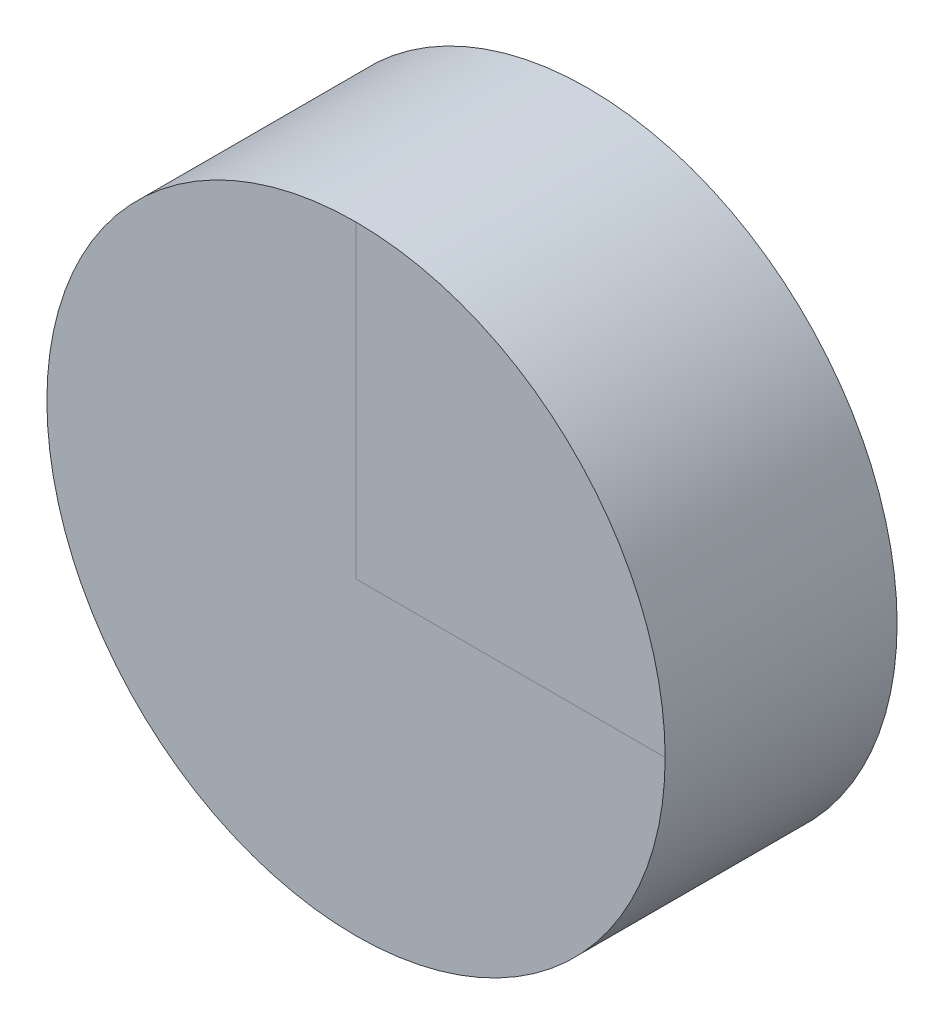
from build123d import *

# Parameters (mm, degrees)
SKETCH1_R      = 200
EXTRUDE1_DEPTH = 150.08


with BuildPart() as part:
    # Sketch1 → Extrude1 (new body)
    with BuildSketch(Plane.XY):
        Circle(SKETCH1_R)
    extrude(amount=EXTRUDE1_DEPTH)


solid = part.part
